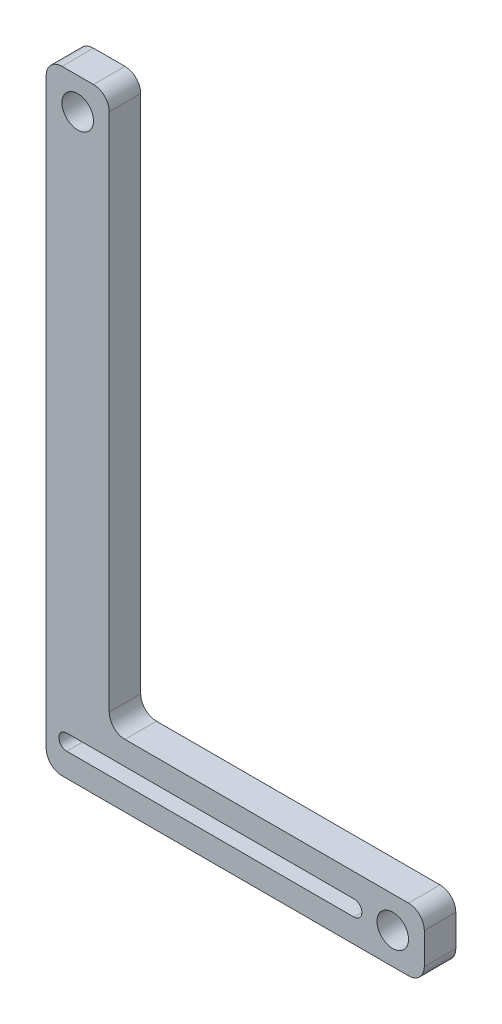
from build123d import *

# Parameters (mm, degrees)
SKETCH1_R           = 6.35
BOSS_EXTRUDE1_DEPTH = 12.7
FILLET1_R           = 6.35
CUT_EXTRUDE1_DEPTH  = 12.7


with BuildPart() as part:
    # Sketch1 → Boss-Extrude1 (new body)
    with BuildSketch(Plane.XY):
        Polygon((-126.220175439, 247.65), (-151.620175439, 247.65), (-151.620175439, 25.4), (-151.620175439, 0), (-126.220175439, 0), (0.779824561, 0), (0.779824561, 25.4), (-126.220175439, 25.4), align=None)
        with Locations((-11.920175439, 12.7)):
            Circle(SKETCH1_R, mode=Mode.SUBTRACT)
        with Locations((-138.920175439, 234.95)):
            Circle(SKETCH1_R, mode=Mode.SUBTRACT)
    extrude(amount=-BOSS_EXTRUDE1_DEPTH)

    # Fillet1
    fillet1_edges = [part.edges().sort_by_distance(p)[0] for p in [
        (-151.620175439, 0, -6.35),
        (-151.620175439, 247.65, -6.35),
        (-126.220175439, 247.65, -6.35),
        (-126.220175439, 25.4, -6.35),
        (0.779824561, 25.4, -6.35),
        (0.779824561, 0, -6.35),
    ]]
    fillet(fillet1_edges, radius=FILLET1_R)

    # Sketch2 → Cut-Extrude1 (cut)
    with BuildSketch(Plane(origin=(0, 0, -12.7), x_dir=(-1, 0, 0), z_dir=(0, 0, -1))):
        with BuildLine():
            Line((27.541342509, 15.875), (143.360549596, 15.875))
            ThreePointArc((143.360549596, 15.875), (146.535549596, 12.7), (143.360549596, 9.525))
            Line((143.360549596, 9.525), (27.541342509, 9.525))
            ThreePointArc((27.541342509, 9.525), (24.366342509, 12.7), (27.541342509, 15.875))
        make_face()
    extrude(amount=-CUT_EXTRUDE1_DEPTH, mode=Mode.SUBTRACT)


solid = part.part
